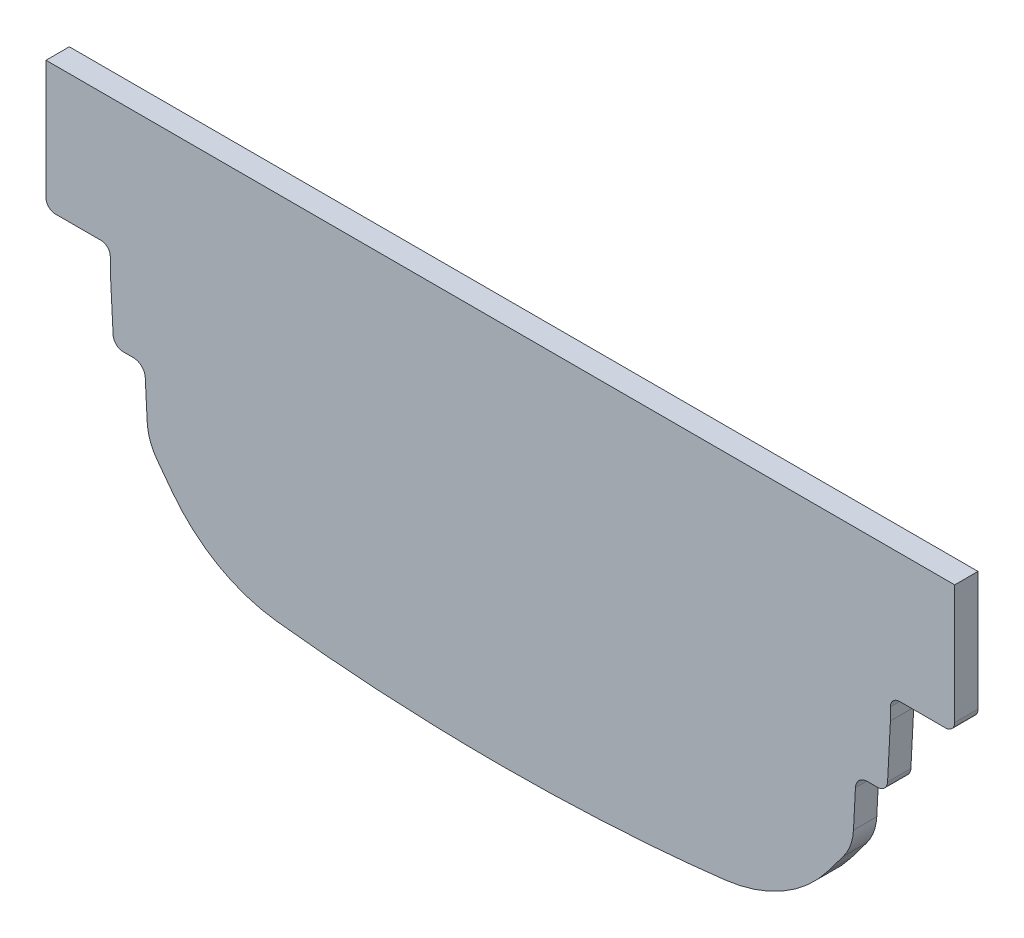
ISO-10303-21;
HEADER;
FILE_DESCRIPTION(('STEP AP214'),'2;1');
FILE_NAME('part.step','',(''),(''),'','','');
FILE_SCHEMA(('AUTOMOTIVE_DESIGN { 1 0 10303 214 1 1 1 1 }'));
ENDSEC;
DATA;
#1=APPLICATION_CONTEXT('core data for automotive mechanical design processes');
#2=APPLICATION_PROTOCOL_DEFINITION('international standard','automotive_design',2000,#1);
#3=PRODUCT_CONTEXT('',#1,'mechanical');
#4=PRODUCT('Part','Part','',(#3));
#5=PRODUCT_RELATED_PRODUCT_CATEGORY('part','',(#4));
#6=PRODUCT_DEFINITION_FORMATION('','',#4);
#7=PRODUCT_DEFINITION_CONTEXT('part definition',#1,'design');
#8=PRODUCT_DEFINITION('design','',#6,#7);
#9=PRODUCT_DEFINITION_SHAPE('','',#8);
#10=(LENGTH_UNIT() NAMED_UNIT(*) SI_UNIT(.MILLI.,.METRE.));
#11=(NAMED_UNIT(*) PLANE_ANGLE_UNIT() SI_UNIT($,.RADIAN.));
#12=(NAMED_UNIT(*) SI_UNIT($,.STERADIAN.) SOLID_ANGLE_UNIT());
#13=UNCERTAINTY_MEASURE_WITH_UNIT(LENGTH_MEASURE(1.E-05),#10,'distance_accuracy_value','');
#14=(GEOMETRIC_REPRESENTATION_CONTEXT(3) GLOBAL_UNCERTAINTY_ASSIGNED_CONTEXT((#13)) GLOBAL_UNIT_ASSIGNED_CONTEXT((#10,
#11,#12)) REPRESENTATION_CONTEXT('',''));
#15=CARTESIAN_POINT('',(0.,0.,0.));
#16=DIRECTION('',(0.,0.,1.));
#17=DIRECTION('',(1.,0.,0.));
#18=AXIS2_PLACEMENT_3D('',#15,#16,#17);
#19=CARTESIAN_POINT('',(2.41085328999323E-11,-224.706000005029,52.05));
#20=CARTESIAN_POINT('',(20.4163783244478,-224.706022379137,52.05));
#21=CARTESIAN_POINT('',(61.2536807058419,-223.588540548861,52.05));
#22=CARTESIAN_POINT('',(101.945891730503,-220.139537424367,52.05));
#23=CARTESIAN_POINT('',(122.213388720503,-217.742637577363,52.05));
#24=B_SPLINE_CURVE_WITH_KNOTS('',3,(#19,#20,#21,#22,#23),.UNSPECIFIED.,.F.,.F.,(4,1,4),(0.,
0.249955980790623,0.499955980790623),.UNSPECIFIED.);
#25=DIRECTION('',(0.,0.,1.));
#26=VECTOR('',#25,1.);
#27=SURFACE_OF_LINEAR_EXTRUSION('',#24,#26);
#28=CARTESIAN_POINT('',(2.41085328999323E-11,-224.706000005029,64.75));
#29=CARTESIAN_POINT('',(20.4163783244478,-224.706022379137,64.75));
#30=CARTESIAN_POINT('',(61.2536807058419,-223.588540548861,64.75));
#31=CARTESIAN_POINT('',(101.945891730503,-220.139537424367,64.75));
#32=CARTESIAN_POINT('',(122.213388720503,-217.742637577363,64.75));
#33=B_SPLINE_CURVE_WITH_KNOTS('',3,(#28,#29,#30,#31,#32),.UNSPECIFIED.,.F.,.F.,(4,1,4),(0.,
0.249955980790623,0.499955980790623),.UNSPECIFIED.);
#34=CARTESIAN_POINT('',(2.41085328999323E-11,-224.706000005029,64.75));
#35=VERTEX_POINT('',#34);
#36=CARTESIAN_POINT('',(122.2133887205,-217.742637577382,64.75));
#37=VERTEX_POINT('',#36);
#38=EDGE_CURVE('E263',#35,#37,#33,.T.);
#39=ORIENTED_EDGE('',*,*,#38,.F.);
#40=DIRECTION('',(0.,0.,1.));
#41=VECTOR('',#40,1.);
#42=CARTESIAN_POINT('',(2.41085328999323E-11,-224.706000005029,52.05));
#43=LINE('',#42,#41);
#44=CARTESIAN_POINT('',(2.41085328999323E-11,-224.706000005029,52.05));
#45=VERTEX_POINT('',#44);
#46=EDGE_CURVE('E11',#45,#35,#43,.T.);
#47=ORIENTED_EDGE('',*,*,#46,.F.);
#48=CARTESIAN_POINT('',(122.2133887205,-217.742637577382,52.05));
#49=VERTEX_POINT('',#48);
#50=EDGE_CURVE('E390',#45,#49,#24,.T.);
#51=ORIENTED_EDGE('',*,*,#50,.T.);
#52=DIRECTION('',(0.,0.,1.));
#53=VECTOR('',#52,1.);
#54=CARTESIAN_POINT('',(122.2133887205,-217.742637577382,52.05));
#55=LINE('',#54,#53);
#56=EDGE_CURVE('E40',#49,#37,#55,.T.);
#57=ORIENTED_EDGE('',*,*,#56,.T.);
#58=EDGE_LOOP('',(#39,#47,#51,#57));
#59=FACE_BOUND('',#58,.T.);
#60=ADVANCED_FACE('F36',(#59),#27,.T.);
#61=CARTESIAN_POINT('',(-122.213388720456,-217.742637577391,52.05));
#62=CARTESIAN_POINT('',(-101.945891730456,-220.139537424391,52.05));
#63=CARTESIAN_POINT('',(-61.2536807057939,-223.588540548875,52.05));
#64=CARTESIAN_POINT('',(-20.4163783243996,-224.706022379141,52.05));
#65=CARTESIAN_POINT('',(2.41085328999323E-11,-224.706000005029,52.05));
#66=B_SPLINE_CURVE_WITH_KNOTS('',3,(#61,#62,#63,#64,#65),.UNSPECIFIED.,.F.,.F.,(4,1,4),(0.,0.25,
0.499955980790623),.UNSPECIFIED.);
#67=DIRECTION('',(0.,0.,1.));
#68=VECTOR('',#67,1.);
#69=SURFACE_OF_LINEAR_EXTRUSION('',#66,#68);
#70=CARTESIAN_POINT('',(-122.213388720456,-217.742637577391,64.75));
#71=CARTESIAN_POINT('',(-101.945891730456,-220.139537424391,64.75));
#72=CARTESIAN_POINT('',(-61.2536807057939,-223.588540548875,64.75));
#73=CARTESIAN_POINT('',(-20.4163783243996,-224.706022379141,64.75));
#74=CARTESIAN_POINT('',(2.41085328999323E-11,-224.706000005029,64.75));
#75=B_SPLINE_CURVE_WITH_KNOTS('',3,(#70,#71,#72,#73,#74),.UNSPECIFIED.,.F.,.F.,(4,1,4),(0.,0.25,
0.499955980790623),.UNSPECIFIED.);
#76=CARTESIAN_POINT('',(-122.213388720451,-217.742637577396,64.75));
#77=VERTEX_POINT('',#76);
#78=EDGE_CURVE('E389',#77,#35,#75,.T.);
#79=ORIENTED_EDGE('',*,*,#78,.F.);
#80=DIRECTION('',(0.,0.,1.));
#81=VECTOR('',#80,1.);
#82=CARTESIAN_POINT('',(-122.213388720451,-217.742637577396,52.05));
#83=LINE('',#82,#81);
#84=CARTESIAN_POINT('',(-122.213388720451,-217.742637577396,52.05));
#85=VERTEX_POINT('',#84);
#86=EDGE_CURVE('E46',#85,#77,#83,.T.);
#87=ORIENTED_EDGE('',*,*,#86,.F.);
#88=EDGE_CURVE('E250',#85,#45,#66,.T.);
#89=ORIENTED_EDGE('',*,*,#88,.T.);
#90=ORIENTED_EDGE('',*,*,#46,.T.);
#91=EDGE_LOOP('',(#79,#87,#89,#90));
#92=FACE_BOUND('',#91,.T.);
#93=ADVANCED_FACE('F271',(#92),#69,.T.);
#94=CARTESIAN_POINT('',(-112.500000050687,-135.609011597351,52.05));
#95=DIRECTION('',(0.,0.,1.));
#96=DIRECTION('',(1.,0.,0.));
#97=AXIS2_PLACEMENT_3D('',#94,#95,#96);
#98=CYLINDRICAL_SURFACE('',#97,82.7060000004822);
#99=CARTESIAN_POINT('',(-112.500000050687,-135.609011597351,64.75));
#100=DIRECTION('',(0.,0.,1.));
#101=DIRECTION('',(1.,0.,0.));
#102=AXIS2_PLACEMENT_3D('',#99,#100,#101);
#103=CIRCLE('',#102,82.7060000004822);
#104=CARTESIAN_POINT('',(-178.552225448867,-185.38235743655,64.75));
#105=VERTEX_POINT('',#104);
#106=EDGE_CURVE('E237',#105,#77,#103,.T.);
#107=ORIENTED_EDGE('',*,*,#106,.F.);
#108=DIRECTION('',(0.,0.,1.));
#109=VECTOR('',#108,1.);
#110=CARTESIAN_POINT('',(-178.552225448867,-185.38235743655,52.05));
#111=LINE('',#110,#109);
#112=CARTESIAN_POINT('',(-178.552225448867,-185.38235743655,52.05));
#113=VERTEX_POINT('',#112);
#114=EDGE_CURVE('E232',#113,#105,#111,.T.);
#115=ORIENTED_EDGE('',*,*,#114,.F.);
#116=CARTESIAN_POINT('',(-112.500000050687,-135.609011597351,52.05));
#117=DIRECTION('',(0.,0.,1.));
#118=DIRECTION('',(1.,0.,0.));
#119=AXIS2_PLACEMENT_3D('',#116,#117,#118);
#120=CIRCLE('',#119,82.7060000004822);
#121=EDGE_CURVE('E235',#113,#85,#120,.T.);
#122=ORIENTED_EDGE('',*,*,#121,.T.);
#123=ORIENTED_EDGE('',*,*,#86,.T.);
#124=EDGE_LOOP('',(#107,#115,#122,#123));
#125=FACE_BOUND('',#124,.T.);
#126=ADVANCED_FACE('F234',(#125),#98,.T.);
#127=CARTESIAN_POINT('',(3277.94075375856,2419.24177759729,52.05));
#128=DIRECTION('',(0.,0.,1.));
#129=DIRECTION('',(1.,0.,0.));
#130=AXIS2_PLACEMENT_3D('',#127,#128,#129);
#131=CYLINDRICAL_SURFACE('',#130,4327.97996761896);
#132=CARTESIAN_POINT('',(3277.94075375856,2419.24177759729,64.75));
#133=DIRECTION('',(0.,0.,1.));
#134=DIRECTION('',(1.,0.,0.));
#135=AXIS2_PLACEMENT_3D('',#132,#133,#134);
#136=CIRCLE('',#135,4327.97996761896);
#137=CARTESIAN_POINT('',(-186.874544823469,-174.30127136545,64.75));
#138=VERTEX_POINT('',#137);
#139=EDGE_CURVE('E393',#138,#105,#136,.T.);
#140=ORIENTED_EDGE('',*,*,#139,.F.);
#141=DIRECTION('',(0.,0.,1.));
#142=VECTOR('',#141,1.);
#143=CARTESIAN_POINT('',(-186.874544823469,-174.30127136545,52.05));
#144=LINE('',#143,#142);
#145=CARTESIAN_POINT('',(-186.874544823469,-174.30127136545,52.05));
#146=VERTEX_POINT('',#145);
#147=EDGE_CURVE('E242',#146,#138,#144,.T.);
#148=ORIENTED_EDGE('',*,*,#147,.F.);
#149=CARTESIAN_POINT('',(3277.94075375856,2419.24177759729,52.05));
#150=DIRECTION('',(0.,0.,1.));
#151=DIRECTION('',(1.,0.,0.));
#152=AXIS2_PLACEMENT_3D('',#149,#150,#151);
#153=CIRCLE('',#152,4327.97996761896);
#154=EDGE_CURVE('E248',#146,#113,#153,.T.);
#155=ORIENTED_EDGE('',*,*,#154,.T.);
#156=ORIENTED_EDGE('',*,*,#114,.T.);
#157=EDGE_LOOP('',(#140,#148,#155,#156));
#158=FACE_BOUND('',#157,.T.);
#159=ADVANCED_FACE('F252',(#158),#131,.T.);
#160=CARTESIAN_POINT('',(-164.859096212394,-157.821889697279,52.05));
#161=DIRECTION('',(0.,0.,1.));
#162=DIRECTION('',(1.,0.,0.));
#163=AXIS2_PLACEMENT_3D('',#160,#161,#162);
#164=CYLINDRICAL_SURFACE('',#163,27.4999999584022);
#165=CARTESIAN_POINT('',(-164.859096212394,-157.821889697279,64.75));
#166=DIRECTION('',(0.,0.,1.));
#167=DIRECTION('',(1.,0.,0.));
#168=AXIS2_PLACEMENT_3D('',#165,#166,#167);
#169=CIRCLE('',#168,27.4999999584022);
#170=CARTESIAN_POINT('',(-192.321408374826,-159.261128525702,64.75));
#171=VERTEX_POINT('',#170);
#172=EDGE_CURVE('E525',#171,#138,#169,.T.);
#173=ORIENTED_EDGE('',*,*,#172,.F.);
#174=DIRECTION('',(0.,0.,1.));
#175=VECTOR('',#174,1.);
#176=CARTESIAN_POINT('',(-192.321408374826,-159.261128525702,52.05));
#177=LINE('',#176,#175);
#178=CARTESIAN_POINT('',(-192.321408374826,-159.261128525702,52.05));
#179=VERTEX_POINT('',#178);
#180=EDGE_CURVE('E404',#179,#171,#177,.T.);
#181=ORIENTED_EDGE('',*,*,#180,.F.);
#182=CARTESIAN_POINT('',(-164.859096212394,-157.821889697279,52.05));
#183=DIRECTION('',(0.,0.,1.));
#184=DIRECTION('',(1.,0.,0.));
#185=AXIS2_PLACEMENT_3D('',#182,#183,#184);
#186=CIRCLE('',#185,27.4999999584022);
#187=EDGE_CURVE('E253',#179,#146,#186,.T.);
#188=ORIENTED_EDGE('',*,*,#187,.T.);
#189=ORIENTED_EDGE('',*,*,#147,.T.);
#190=EDGE_LOOP('',(#173,#181,#188,#189));
#191=FACE_BOUND('',#190,.T.);
#192=ADVANCED_FACE('F281',(#191),#164,.T.);
#193=CARTESIAN_POINT('',(-193.401077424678,-138.659816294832,52.05));
#194=DIRECTION('',(-0.998629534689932,-0.0523359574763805,0.));
#195=DIRECTION('',(0.0523359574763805,-0.998629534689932,0.));
#196=AXIS2_PLACEMENT_3D('',#193,#194,#195);
#197=PLANE('',#196);
#198=DIRECTION('',(0.0523359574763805,-0.998629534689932,0.));
#199=VECTOR('',#198,1.);
#200=CARTESIAN_POINT('',(-193.401077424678,-138.659816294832,64.75));
#201=LINE('',#200,#199);
#202=CARTESIAN_POINT('',(-193.401077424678,-138.659816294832,64.75));
#203=VERTEX_POINT('',#202);
#204=EDGE_CURVE('E522',#203,#171,#201,.T.);
#205=ORIENTED_EDGE('',*,*,#204,.F.);
#206=DIRECTION('',(0.,0.,1.));
#207=VECTOR('',#206,1.);
#208=CARTESIAN_POINT('',(-193.401077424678,-138.659816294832,52.05));
#209=LINE('',#208,#207);
#210=CARTESIAN_POINT('',(-193.401077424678,-138.659816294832,52.05));
#211=VERTEX_POINT('',#210);
#212=EDGE_CURVE('E406',#211,#203,#209,.T.);
#213=ORIENTED_EDGE('',*,*,#212,.F.);
#214=DIRECTION('',(0.0523359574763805,-0.998629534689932,0.));
#215=VECTOR('',#214,1.);
#216=CARTESIAN_POINT('',(-193.401077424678,-138.659816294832,52.05));
#217=LINE('',#216,#215);
#218=EDGE_CURVE('E255',#211,#179,#217,.T.);
#219=ORIENTED_EDGE('',*,*,#218,.T.);
#220=ORIENTED_EDGE('',*,*,#180,.T.);
#221=EDGE_LOOP('',(#205,#213,#219,#220));
#222=FACE_BOUND('',#221,.T.);
#223=ADVANCED_FACE('F284',(#222),#197,.T.);
#224=CARTESIAN_POINT('',(-199.892169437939,-139.000000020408,52.05));
#225=DIRECTION('',(0.,0.,1.));
#226=DIRECTION('',(1.,0.,0.));
#227=AXIS2_PLACEMENT_3D('',#224,#225,#226);
#228=CYLINDRICAL_SURFACE('',#227,6.50000003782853);
#229=CARTESIAN_POINT('',(-199.892169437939,-139.000000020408,64.75));
#230=DIRECTION('',(0.,0.,-1.));
#231=DIRECTION('',(-1.,0.,0.));
#232=AXIS2_PLACEMENT_3D('',#229,#230,#231);
#233=CIRCLE('',#232,6.50000003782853);
#234=CARTESIAN_POINT('',(-199.892169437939,-132.499999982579,64.75));
#235=VERTEX_POINT('',#234);
#236=EDGE_CURVE('E519',#235,#203,#233,.T.);
#237=ORIENTED_EDGE('',*,*,#236,.F.);
#238=DIRECTION('',(0.,0.,1.));
#239=VECTOR('',#238,1.);
#240=CARTESIAN_POINT('',(-199.892169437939,-132.499999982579,52.05));
#241=LINE('',#240,#239);
#242=CARTESIAN_POINT('',(-199.892169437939,-132.499999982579,52.05));
#243=VERTEX_POINT('',#242);
#244=EDGE_CURVE('E408',#243,#235,#241,.T.);
#245=ORIENTED_EDGE('',*,*,#244,.F.);
#246=CARTESIAN_POINT('',(-199.892169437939,-139.000000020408,52.05));
#247=DIRECTION('',(0.,0.,-1.));
#248=DIRECTION('',(-1.,0.,0.));
#249=AXIS2_PLACEMENT_3D('',#246,#247,#248);
#250=CIRCLE('',#249,6.50000003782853);
#251=EDGE_CURVE('E533',#243,#211,#250,.T.);
#252=ORIENTED_EDGE('',*,*,#251,.T.);
#253=ORIENTED_EDGE('',*,*,#212,.T.);
#254=EDGE_LOOP('',(#237,#245,#252,#253));
#255=FACE_BOUND('',#254,.T.);
#256=ADVANCED_FACE('F288',(#255),#228,.F.);
#257=CARTESIAN_POINT('',(-205.408283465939,-132.499999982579,52.05));
#258=DIRECTION('',(0.,-1.,0.));
#259=DIRECTION('',(1.,0.,0.));
#260=AXIS2_PLACEMENT_3D('',#257,#258,#259);
#261=PLANE('',#260);
#262=DIRECTION('',(1.,0.,0.));
#263=VECTOR('',#262,1.);
#264=CARTESIAN_POINT('',(-205.408283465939,-132.499999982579,64.75));
#265=LINE('',#264,#263);
#266=CARTESIAN_POINT('',(-205.408283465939,-132.499999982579,64.75));
#267=VERTEX_POINT('',#266);
#268=EDGE_CURVE('E516',#267,#235,#265,.T.);
#269=ORIENTED_EDGE('',*,*,#268,.F.);
#270=DIRECTION('',(0.,0.,1.));
#271=VECTOR('',#270,1.);
#272=CARTESIAN_POINT('',(-205.408283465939,-132.499999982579,52.05));
#273=LINE('',#272,#271);
#274=CARTESIAN_POINT('',(-205.408283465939,-132.499999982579,52.05));
#275=VERTEX_POINT('',#274);
#276=EDGE_CURVE('E410',#275,#267,#273,.T.);
#277=ORIENTED_EDGE('',*,*,#276,.F.);
#278=DIRECTION('',(1.,0.,0.));
#279=VECTOR('',#278,1.);
#280=CARTESIAN_POINT('',(-205.408283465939,-132.499999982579,52.05));
#281=LINE('',#280,#279);
#282=EDGE_CURVE('E534',#275,#243,#281,.T.);
#283=ORIENTED_EDGE('',*,*,#282,.T.);
#284=ORIENTED_EDGE('',*,*,#244,.T.);
#285=EDGE_LOOP('',(#269,#277,#283,#284));
#286=FACE_BOUND('',#285,.T.);
#287=ADVANCED_FACE('F292',(#286),#261,.T.);
#288=CARTESIAN_POINT('',(-205.408283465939,-126.999999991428,52.05));
#289=DIRECTION('',(0.,0.,1.));
#290=DIRECTION('',(1.,0.,0.));
#291=AXIS2_PLACEMENT_3D('',#288,#289,#290);
#292=CYLINDRICAL_SURFACE('',#291,5.49999999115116);
#293=CARTESIAN_POINT('',(-205.408283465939,-126.999999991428,64.75));
#294=DIRECTION('',(0.,0.,1.));
#295=DIRECTION('',(1.,0.,0.));
#296=AXIS2_PLACEMENT_3D('',#293,#294,#295);
#297=CIRCLE('',#296,5.49999999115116);
#298=CARTESIAN_POINT('',(-210.900745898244,-127.287847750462,64.75));
#299=VERTEX_POINT('',#298);
#300=EDGE_CURVE('E513',#299,#267,#297,.T.);
#301=ORIENTED_EDGE('',*,*,#300,.F.);
#302=DIRECTION('',(0.,0.,1.));
#303=VECTOR('',#302,1.);
#304=CARTESIAN_POINT('',(-210.900745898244,-127.287847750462,52.05));
#305=LINE('',#304,#303);
#306=CARTESIAN_POINT('',(-210.900745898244,-127.287847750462,52.05));
#307=VERTEX_POINT('',#306);
#308=EDGE_CURVE('E412',#307,#299,#305,.T.);
#309=ORIENTED_EDGE('',*,*,#308,.F.);
#310=CARTESIAN_POINT('',(-205.408283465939,-126.999999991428,52.05));
#311=DIRECTION('',(0.,0.,1.));
#312=DIRECTION('',(1.,0.,0.));
#313=AXIS2_PLACEMENT_3D('',#310,#311,#312);
#314=CIRCLE('',#313,5.49999999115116);
#315=EDGE_CURVE('E539',#307,#275,#314,.T.);
#316=ORIENTED_EDGE('',*,*,#315,.T.);
#317=ORIENTED_EDGE('',*,*,#276,.T.);
#318=EDGE_LOOP('',(#301,#309,#316,#317));
#319=FACE_BOUND('',#318,.T.);
#320=ADVANCED_FACE('F296',(#319),#292,.T.);
#321=CARTESIAN_POINT('',(-212.45348523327,-97.6598162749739,52.05));
#322=DIRECTION('',(-0.998629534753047,-0.0523359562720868,0.));
#323=DIRECTION('',(0.0523359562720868,-0.998629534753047,0.));
#324=AXIS2_PLACEMENT_3D('',#321,#322,#323);
#325=PLANE('',#324);
#326=DIRECTION('',(0.0523359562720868,-0.998629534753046,0.));
#327=VECTOR('',#326,1.);
#328=CARTESIAN_POINT('',(-212.45348523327,-97.6598162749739,64.75));
#329=LINE('',#328,#327);
#330=CARTESIAN_POINT('',(-212.45348523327,-97.6598162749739,64.75));
#331=VERTEX_POINT('',#330);
#332=EDGE_CURVE('E510',#331,#299,#329,.T.);
#333=ORIENTED_EDGE('',*,*,#332,.F.);
#334=DIRECTION('',(0.,0.,1.));
#335=VECTOR('',#334,1.);
#336=CARTESIAN_POINT('',(-212.45348523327,-97.6598162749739,52.05));
#337=LINE('',#336,#335);
#338=CARTESIAN_POINT('',(-212.45348523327,-97.6598162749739,52.05));
#339=VERTEX_POINT('',#338);
#340=EDGE_CURVE('E414',#339,#331,#337,.T.);
#341=ORIENTED_EDGE('',*,*,#340,.F.);
#342=DIRECTION('',(0.0523359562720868,-0.998629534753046,0.));
#343=VECTOR('',#342,1.);
#344=CARTESIAN_POINT('',(-212.45348523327,-97.6598162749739,52.05));
#345=LINE('',#344,#343);
#346=EDGE_CURVE('E542',#339,#307,#345,.T.);
#347=ORIENTED_EDGE('',*,*,#346,.T.);
#348=ORIENTED_EDGE('',*,*,#308,.T.);
#349=EDGE_LOOP('',(#333,#341,#347,#348));
#350=FACE_BOUND('',#349,.T.);
#351=ADVANCED_FACE('F300',(#350),#325,.T.);
#352=CARTESIAN_POINT('',(-212.45348523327,-90.9999999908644,52.05));
#353=DIRECTION('',(-1.,0.,0.));
#354=DIRECTION('',(0.,0.,1.));
#355=AXIS2_PLACEMENT_3D('',#352,#353,#354);
#356=PLANE('',#355);
#357=DIRECTION('',(0.,-1.,0.));
#358=VECTOR('',#357,1.);
#359=CARTESIAN_POINT('',(-212.45348523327,-90.9999999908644,64.75));
#360=LINE('',#359,#358);
#361=CARTESIAN_POINT('',(-212.45348523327,-90.9999999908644,64.75));
#362=VERTEX_POINT('',#361);
#363=EDGE_CURVE('E507',#362,#331,#360,.T.);
#364=ORIENTED_EDGE('',*,*,#363,.F.);
#365=DIRECTION('',(0.,0.,1.));
#366=VECTOR('',#365,1.);
#367=CARTESIAN_POINT('',(-212.45348523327,-90.9999999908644,52.05));
#368=LINE('',#367,#366);
#369=CARTESIAN_POINT('',(-212.45348523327,-90.9999999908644,52.05));
#370=VERTEX_POINT('',#369);
#371=EDGE_CURVE('E416',#370,#362,#368,.T.);
#372=ORIENTED_EDGE('',*,*,#371,.F.);
#373=DIRECTION('',(0.,-1.,0.));
#374=VECTOR('',#373,1.);
#375=CARTESIAN_POINT('',(-212.45348523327,-90.9999999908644,52.05));
#376=LINE('',#375,#374);
#377=EDGE_CURVE('E545',#370,#339,#376,.T.);
#378=ORIENTED_EDGE('',*,*,#377,.T.);
#379=ORIENTED_EDGE('',*,*,#340,.T.);
#380=EDGE_LOOP('',(#364,#372,#378,#379));
#381=FACE_BOUND('',#380,.T.);
#382=ADVANCED_FACE('F304',(#381),#356,.T.);
#383=CARTESIAN_POINT('',(-217.45348523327,-90.9999999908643,52.05));
#384=DIRECTION('',(0.,0.,1.));
#385=DIRECTION('',(1.,0.,0.));
#386=AXIS2_PLACEMENT_3D('',#383,#384,#385);
#387=CYLINDRICAL_SURFACE('',#386,5.);
#388=CARTESIAN_POINT('',(-217.45348523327,-90.9999999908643,64.75));
#389=DIRECTION('',(0.,0.,-1.));
#390=DIRECTION('',(-1.,0.,0.));
#391=AXIS2_PLACEMENT_3D('',#388,#389,#390);
#392=CIRCLE('',#391,5.);
#393=CARTESIAN_POINT('',(-217.45348523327,-85.9999999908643,64.75));
#394=VERTEX_POINT('',#393);
#395=EDGE_CURVE('E504',#394,#362,#392,.T.);
#396=ORIENTED_EDGE('',*,*,#395,.F.);
#397=DIRECTION('',(0.,0.,1.));
#398=VECTOR('',#397,1.);
#399=CARTESIAN_POINT('',(-217.45348523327,-85.9999999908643,52.05));
#400=LINE('',#399,#398);
#401=CARTESIAN_POINT('',(-217.45348523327,-85.9999999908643,52.05));
#402=VERTEX_POINT('',#401);
#403=EDGE_CURVE('E418',#402,#394,#400,.T.);
#404=ORIENTED_EDGE('',*,*,#403,.F.);
#405=CARTESIAN_POINT('',(-217.45348523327,-90.9999999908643,52.05));
#406=DIRECTION('',(0.,0.,-1.));
#407=DIRECTION('',(-1.,0.,0.));
#408=AXIS2_PLACEMENT_3D('',#405,#406,#407);
#409=CIRCLE('',#408,5.);
#410=EDGE_CURVE('E548',#402,#370,#409,.T.);
#411=ORIENTED_EDGE('',*,*,#410,.T.);
#412=ORIENTED_EDGE('',*,*,#371,.T.);
#413=EDGE_LOOP('',(#396,#404,#411,#412));
#414=FACE_BOUND('',#413,.T.);
#415=ADVANCED_FACE('F308',(#414),#387,.F.);
#416=CARTESIAN_POINT('',(-242.45348523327,-85.9999999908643,52.05));
#417=DIRECTION('',(0.,-1.,0.));
#418=DIRECTION('',(1.,0.,0.));
#419=AXIS2_PLACEMENT_3D('',#416,#417,#418);
#420=PLANE('',#419);
#421=DIRECTION('',(1.,0.,0.));
#422=VECTOR('',#421,1.);
#423=CARTESIAN_POINT('',(-242.45348523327,-85.9999999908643,64.75));
#424=LINE('',#423,#422);
#425=CARTESIAN_POINT('',(-242.45348523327,-85.9999999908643,64.75));
#426=VERTEX_POINT('',#425);
#427=EDGE_CURVE('E501',#426,#394,#424,.T.);
#428=ORIENTED_EDGE('',*,*,#427,.F.);
#429=DIRECTION('',(0.,0.,1.));
#430=VECTOR('',#429,1.);
#431=CARTESIAN_POINT('',(-242.45348523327,-85.9999999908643,52.05));
#432=LINE('',#431,#430);
#433=CARTESIAN_POINT('',(-242.45348523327,-85.9999999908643,52.05));
#434=VERTEX_POINT('',#433);
#435=EDGE_CURVE('E420',#434,#426,#432,.T.);
#436=ORIENTED_EDGE('',*,*,#435,.F.);
#437=DIRECTION('',(1.,0.,0.));
#438=VECTOR('',#437,1.);
#439=CARTESIAN_POINT('',(-242.45348523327,-85.9999999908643,52.05));
#440=LINE('',#439,#438);
#441=EDGE_CURVE('E551',#434,#402,#440,.T.);
#442=ORIENTED_EDGE('',*,*,#441,.T.);
#443=ORIENTED_EDGE('',*,*,#403,.T.);
#444=EDGE_LOOP('',(#428,#436,#442,#443));
#445=FACE_BOUND('',#444,.T.);
#446=ADVANCED_FACE('F312',(#445),#420,.T.);
#447=CARTESIAN_POINT('',(-242.45348523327,-80.9999999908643,52.05));
#448=DIRECTION('',(0.,0.,1.));
#449=DIRECTION('',(1.,0.,0.));
#450=AXIS2_PLACEMENT_3D('',#447,#448,#449);
#451=CYLINDRICAL_SURFACE('',#450,5.);
#452=CARTESIAN_POINT('',(-242.45348523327,-80.9999999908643,64.75));
#453=DIRECTION('',(0.,0.,1.));
#454=DIRECTION('',(1.,0.,0.));
#455=AXIS2_PLACEMENT_3D('',#452,#453,#454);
#456=CIRCLE('',#455,5.);
#457=CARTESIAN_POINT('',(-247.45348523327,-80.9999999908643,64.75));
#458=VERTEX_POINT('',#457);
#459=EDGE_CURVE('E498',#458,#426,#456,.T.);
#460=ORIENTED_EDGE('',*,*,#459,.F.);
#461=DIRECTION('',(0.,0.,1.));
#462=VECTOR('',#461,1.);
#463=CARTESIAN_POINT('',(-247.45348523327,-80.9999999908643,52.05));
#464=LINE('',#463,#462);
#465=CARTESIAN_POINT('',(-247.45348523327,-80.9999999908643,52.05));
#466=VERTEX_POINT('',#465);
#467=EDGE_CURVE('E422',#466,#458,#464,.T.);
#468=ORIENTED_EDGE('',*,*,#467,.F.);
#469=CARTESIAN_POINT('',(-242.45348523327,-80.9999999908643,52.05));
#470=DIRECTION('',(0.,0.,1.));
#471=DIRECTION('',(1.,0.,0.));
#472=AXIS2_PLACEMENT_3D('',#469,#470,#471);
#473=CIRCLE('',#472,5.);
#474=EDGE_CURVE('E554',#466,#434,#473,.T.);
#475=ORIENTED_EDGE('',*,*,#474,.T.);
#476=ORIENTED_EDGE('',*,*,#435,.T.);
#477=EDGE_LOOP('',(#460,#468,#475,#476));
#478=FACE_BOUND('',#477,.T.);
#479=ADVANCED_FACE('F316',(#478),#451,.T.);
#480=CARTESIAN_POINT('',(-247.45348523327,-15.9999999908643,52.05));
#481=DIRECTION('',(-1.,0.,0.));
#482=DIRECTION('',(0.,0.,1.));
#483=AXIS2_PLACEMENT_3D('',#480,#481,#482);
#484=PLANE('',#483);
#485=DIRECTION('',(0.,-1.,0.));
#486=VECTOR('',#485,1.);
#487=CARTESIAN_POINT('',(-247.45348523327,-15.9999999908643,64.75));
#488=LINE('',#487,#486);
#489=CARTESIAN_POINT('',(-247.45348523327,-15.9999999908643,64.75));
#490=VERTEX_POINT('',#489);
#491=EDGE_CURVE('E495',#490,#458,#488,.T.);
#492=ORIENTED_EDGE('',*,*,#491,.F.);
#493=DIRECTION('',(0.,0.,1.));
#494=VECTOR('',#493,1.);
#495=CARTESIAN_POINT('',(-247.45348523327,-15.9999999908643,52.05));
#496=LINE('',#495,#494);
#497=CARTESIAN_POINT('',(-247.45348523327,-15.9999999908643,52.05));
#498=VERTEX_POINT('',#497);
#499=EDGE_CURVE('E424',#498,#490,#496,.T.);
#500=ORIENTED_EDGE('',*,*,#499,.F.);
#501=DIRECTION('',(0.,-1.,0.));
#502=VECTOR('',#501,1.);
#503=CARTESIAN_POINT('',(-247.45348523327,-15.9999999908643,52.05));
#504=LINE('',#503,#502);
#505=EDGE_CURVE('E557',#498,#466,#504,.T.);
#506=ORIENTED_EDGE('',*,*,#505,.T.);
#507=ORIENTED_EDGE('',*,*,#467,.T.);
#508=EDGE_LOOP('',(#492,#500,#506,#507));
#509=FACE_BOUND('',#508,.T.);
#510=ADVANCED_FACE('F320',(#509),#484,.T.);
#511=CARTESIAN_POINT('',(-212.453485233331,-15.9999999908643,52.05));
#512=DIRECTION('',(0.,1.,0.));
#513=DIRECTION('',(-1.,0.,0.));
#514=AXIS2_PLACEMENT_3D('',#511,#512,#513);
#515=PLANE('',#514);
#516=DIRECTION('',(-1.,0.,0.));
#517=VECTOR('',#516,1.);
#518=CARTESIAN_POINT('',(-212.453485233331,-15.9999999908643,64.75));
#519=LINE('',#518,#517);
#520=CARTESIAN_POINT('',(247.45348523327,-15.9999999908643,64.75));
#521=VERTEX_POINT('',#520);
#522=EDGE_CURVE('E492',#521,#490,#519,.T.);
#523=ORIENTED_EDGE('',*,*,#522,.F.);
#524=DIRECTION('',(0.,0.,1.));
#525=VECTOR('',#524,1.);
#526=CARTESIAN_POINT('',(247.45348523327,-15.9999999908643,52.05));
#527=LINE('',#526,#525);
#528=CARTESIAN_POINT('',(247.45348523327,-15.9999999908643,52.05));
#529=VERTEX_POINT('',#528);
#530=EDGE_CURVE('E426',#529,#521,#527,.T.);
#531=ORIENTED_EDGE('',*,*,#530,.F.);
#532=DIRECTION('',(-1.,1.40244958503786E-12,0.));
#533=VECTOR('',#532,1.);
#534=CARTESIAN_POINT('',(212.453485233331,-15.9999999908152,52.05));
#535=LINE('',#534,#533);
#536=EDGE_CURVE('E560',#529,#498,#535,.T.);
#537=ORIENTED_EDGE('',*,*,#536,.T.);
#538=ORIENTED_EDGE('',*,*,#499,.T.);
#539=EDGE_LOOP('',(#523,#531,#537,#538));
#540=FACE_BOUND('',#539,.T.);
#541=ADVANCED_FACE('F324',(#540),#515,.T.);
#542=CARTESIAN_POINT('',(247.45348523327,-15.9999999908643,52.05));
#543=DIRECTION('',(1.,0.,0.));
#544=DIRECTION('',(0.,0.,-1.));
#545=AXIS2_PLACEMENT_3D('',#542,#543,#544);
#546=PLANE('',#545);
#547=DIRECTION('',(0.,1.,0.));
#548=VECTOR('',#547,1.);
#549=CARTESIAN_POINT('',(247.45348523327,-15.9999999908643,64.75));
#550=LINE('',#549,#548);
#551=CARTESIAN_POINT('',(247.45348523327,-80.9999999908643,64.75));
#552=VERTEX_POINT('',#551);
#553=EDGE_CURVE('E489',#552,#521,#550,.T.);
#554=ORIENTED_EDGE('',*,*,#553,.F.);
#555=DIRECTION('',(0.,0.,1.));
#556=VECTOR('',#555,1.);
#557=CARTESIAN_POINT('',(247.45348523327,-80.9999999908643,52.05));
#558=LINE('',#557,#556);
#559=CARTESIAN_POINT('',(247.45348523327,-80.9999999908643,52.05));
#560=VERTEX_POINT('',#559);
#561=EDGE_CURVE('E429',#560,#552,#558,.T.);
#562=ORIENTED_EDGE('',*,*,#561,.F.);
#563=DIRECTION('',(0.,1.,0.));
#564=VECTOR('',#563,1.);
#565=CARTESIAN_POINT('',(247.45348523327,-15.9999999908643,52.05));
#566=LINE('',#565,#564);
#567=EDGE_CURVE('E562',#560,#529,#566,.T.);
#568=ORIENTED_EDGE('',*,*,#567,.T.);
#569=ORIENTED_EDGE('',*,*,#530,.T.);
#570=EDGE_LOOP('',(#554,#562,#568,#569));
#571=FACE_BOUND('',#570,.T.);
#572=ADVANCED_FACE('F328',(#571),#546,.T.);
#573=CARTESIAN_POINT('',(242.45348523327,-80.9999999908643,52.05));
#574=DIRECTION('',(0.,0.,1.));
#575=DIRECTION('',(1.,0.,0.));
#576=AXIS2_PLACEMENT_3D('',#573,#574,#575);
#577=CYLINDRICAL_SURFACE('',#576,5.);
#578=CARTESIAN_POINT('',(242.45348523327,-80.9999999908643,64.75));
#579=DIRECTION('',(0.,0.,1.));
#580=DIRECTION('',(1.,0.,0.));
#581=AXIS2_PLACEMENT_3D('',#578,#579,#580);
#582=CIRCLE('',#581,5.);
#583=CARTESIAN_POINT('',(242.45348523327,-85.9999999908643,64.75));
#584=VERTEX_POINT('',#583);
#585=EDGE_CURVE('E486',#584,#552,#582,.T.);
#586=ORIENTED_EDGE('',*,*,#585,.F.);
#587=DIRECTION('',(0.,0.,1.));
#588=VECTOR('',#587,1.);
#589=CARTESIAN_POINT('',(242.45348523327,-85.9999999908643,52.05));
#590=LINE('',#589,#588);
#591=CARTESIAN_POINT('',(242.45348523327,-85.9999999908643,52.05));
#592=VERTEX_POINT('',#591);
#593=EDGE_CURVE('E431',#592,#584,#590,.T.);
#594=ORIENTED_EDGE('',*,*,#593,.F.);
#595=CARTESIAN_POINT('',(242.45348523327,-80.9999999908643,52.05));
#596=DIRECTION('',(0.,0.,1.));
#597=DIRECTION('',(1.,0.,0.));
#598=AXIS2_PLACEMENT_3D('',#595,#596,#597);
#599=CIRCLE('',#598,5.);
#600=EDGE_CURVE('E565',#592,#560,#599,.T.);
#601=ORIENTED_EDGE('',*,*,#600,.T.);
#602=ORIENTED_EDGE('',*,*,#561,.T.);
#603=EDGE_LOOP('',(#586,#594,#601,#602));
#604=FACE_BOUND('',#603,.T.);
#605=ADVANCED_FACE('F332',(#604),#577,.T.);
#606=CARTESIAN_POINT('',(242.45348523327,-85.9999999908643,52.05));
#607=DIRECTION('',(-2.00894856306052E-12,-1.,0.));
#608=DIRECTION('',(1.,-2.00894856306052E-12,0.));
#609=AXIS2_PLACEMENT_3D('',#606,#607,#608);
#610=PLANE('',#609);
#611=DIRECTION('',(1.,-2.00894856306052E-12,0.));
#612=VECTOR('',#611,1.);
#613=CARTESIAN_POINT('',(242.45348523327,-85.9999999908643,64.75));
#614=LINE('',#613,#612);
#615=CARTESIAN_POINT('',(217.453485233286,-85.9999999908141,64.75));
#616=VERTEX_POINT('',#615);
#617=EDGE_CURVE('E483',#616,#584,#614,.T.);
#618=ORIENTED_EDGE('',*,*,#617,.F.);
#619=DIRECTION('',(0.,0.,1.));
#620=VECTOR('',#619,1.);
#621=CARTESIAN_POINT('',(217.453485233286,-85.9999999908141,52.05));
#622=LINE('',#621,#620);
#623=CARTESIAN_POINT('',(217.453485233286,-85.9999999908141,52.05));
#624=VERTEX_POINT('',#623);
#625=EDGE_CURVE('E433',#624,#616,#622,.T.);
#626=ORIENTED_EDGE('',*,*,#625,.F.);
#627=DIRECTION('',(1.,-2.00894856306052E-12,0.));
#628=VECTOR('',#627,1.);
#629=CARTESIAN_POINT('',(242.45348523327,-85.9999999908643,52.05));
#630=LINE('',#629,#628);
#631=EDGE_CURVE('E568',#624,#592,#630,.T.);
#632=ORIENTED_EDGE('',*,*,#631,.T.);
#633=ORIENTED_EDGE('',*,*,#593,.T.);
#634=EDGE_LOOP('',(#618,#626,#632,#633));
#635=FACE_BOUND('',#634,.T.);
#636=ADVANCED_FACE('F336',(#635),#610,.T.);
#637=CARTESIAN_POINT('',(217.453485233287,-90.9999999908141,52.05));
#638=DIRECTION('',(0.,0.,1.));
#639=DIRECTION('',(1.,0.,0.));
#640=AXIS2_PLACEMENT_3D('',#637,#638,#639);
#641=CYLINDRICAL_SURFACE('',#640,5.);
#642=CARTESIAN_POINT('',(217.453485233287,-90.9999999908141,64.75));
#643=DIRECTION('',(0.,0.,-1.));
#644=DIRECTION('',(1.,0.,0.));
#645=AXIS2_PLACEMENT_3D('',#642,#643,#644);
#646=CIRCLE('',#645,5.);
#647=CARTESIAN_POINT('',(212.453485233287,-90.9999999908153,64.75));
#648=VERTEX_POINT('',#647);
#649=EDGE_CURVE('E480',#648,#616,#646,.T.);
#650=ORIENTED_EDGE('',*,*,#649,.F.);
#651=DIRECTION('',(0.,0.,1.));
#652=VECTOR('',#651,1.);
#653=CARTESIAN_POINT('',(212.453485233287,-90.9999999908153,52.05));
#654=LINE('',#653,#652);
#655=CARTESIAN_POINT('',(212.453485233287,-90.9999999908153,52.05));
#656=VERTEX_POINT('',#655);
#657=EDGE_CURVE('E435',#656,#648,#654,.T.);
#658=ORIENTED_EDGE('',*,*,#657,.F.);
#659=CARTESIAN_POINT('',(217.453485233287,-90.9999999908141,52.05));
#660=DIRECTION('',(0.,0.,-1.));
#661=DIRECTION('',(1.,0.,0.));
#662=AXIS2_PLACEMENT_3D('',#659,#660,#661);
#663=CIRCLE('',#662,5.);
#664=EDGE_CURVE('E571',#656,#624,#663,.T.);
#665=ORIENTED_EDGE('',*,*,#664,.T.);
#666=ORIENTED_EDGE('',*,*,#625,.T.);
#667=EDGE_LOOP('',(#650,#658,#665,#666));
#668=FACE_BOUND('',#667,.T.);
#669=ADVANCED_FACE('F340',(#668),#641,.F.);
#670=CARTESIAN_POINT('',(212.453485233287,-90.9999999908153,52.05));
#671=DIRECTION('',(1.,2.3338665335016E-13,0.));
#672=DIRECTION('',(-2.3338665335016E-13,1.,0.));
#673=AXIS2_PLACEMENT_3D('',#670,#671,#672);
#674=PLANE('',#673);
#675=DIRECTION('',(-2.3338665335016E-13,1.,0.));
#676=VECTOR('',#675,1.);
#677=CARTESIAN_POINT('',(212.453485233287,-90.9999999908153,64.75));
#678=LINE('',#677,#676);
#679=CARTESIAN_POINT('',(212.453485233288,-97.6598162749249,64.75));
#680=VERTEX_POINT('',#679);
#681=EDGE_CURVE('E477',#680,#648,#678,.T.);
#682=ORIENTED_EDGE('',*,*,#681,.F.);
#683=DIRECTION('',(0.,0.,1.));
#684=VECTOR('',#683,1.);
#685=CARTESIAN_POINT('',(212.453485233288,-97.6598162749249,52.05));
#686=LINE('',#685,#684);
#687=CARTESIAN_POINT('',(212.453485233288,-97.6598162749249,52.05));
#688=VERTEX_POINT('',#687);
#689=EDGE_CURVE('E437',#688,#680,#686,.T.);
#690=ORIENTED_EDGE('',*,*,#689,.F.);
#691=DIRECTION('',(-2.3338665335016E-13,1.,0.));
#692=VECTOR('',#691,1.);
#693=CARTESIAN_POINT('',(212.453485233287,-90.9999999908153,52.05));
#694=LINE('',#693,#692);
#695=EDGE_CURVE('E574',#688,#656,#694,.T.);
#696=ORIENTED_EDGE('',*,*,#695,.T.);
#697=ORIENTED_EDGE('',*,*,#657,.T.);
#698=EDGE_LOOP('',(#682,#690,#696,#697));
#699=FACE_BOUND('',#698,.T.);
#700=ADVANCED_FACE('F344',(#699),#674,.T.);
#701=CARTESIAN_POINT('',(212.453485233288,-97.6598162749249,52.05));
#702=DIRECTION('',(0.998629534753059,-0.0523359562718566,0.));
#703=DIRECTION('',(0.0523359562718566,0.998629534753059,0.));
#704=AXIS2_PLACEMENT_3D('',#701,#702,#703);
#705=PLANE('',#704);
#706=DIRECTION('',(0.0523359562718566,0.998629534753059,0.));
#707=VECTOR('',#706,1.);
#708=CARTESIAN_POINT('',(212.453485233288,-97.6598162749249,64.75));
#709=LINE('',#708,#707);
#710=CARTESIAN_POINT('',(210.90074589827,-127.287847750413,64.75));
#711=VERTEX_POINT('',#710);
#712=EDGE_CURVE('E474',#711,#680,#709,.T.);
#713=ORIENTED_EDGE('',*,*,#712,.F.);
#714=DIRECTION('',(0.,0.,1.));
#715=VECTOR('',#714,1.);
#716=CARTESIAN_POINT('',(210.90074589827,-127.287847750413,52.05));
#717=LINE('',#716,#715);
#718=CARTESIAN_POINT('',(210.90074589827,-127.287847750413,52.05));
#719=VERTEX_POINT('',#718);
#720=EDGE_CURVE('E439',#719,#711,#717,.T.);
#721=ORIENTED_EDGE('',*,*,#720,.F.);
#722=DIRECTION('',(0.0523359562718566,0.998629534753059,0.));
#723=VECTOR('',#722,1.);
#724=CARTESIAN_POINT('',(212.453485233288,-97.6598162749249,52.05));
#725=LINE('',#724,#723);
#726=EDGE_CURVE('E577',#719,#688,#725,.T.);
#727=ORIENTED_EDGE('',*,*,#726,.T.);
#728=ORIENTED_EDGE('',*,*,#689,.T.);
#729=EDGE_LOOP('',(#713,#721,#727,#728));
#730=FACE_BOUND('',#729,.T.);
#731=ADVANCED_FACE('F348',(#730),#705,.T.);
#732=CARTESIAN_POINT('',(205.408283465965,-126.999999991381,52.05));
#733=DIRECTION('',(0.,0.,1.));
#734=DIRECTION('',(1.,0.,0.));
#735=AXIS2_PLACEMENT_3D('',#732,#733,#734);
#736=CYLINDRICAL_SURFACE('',#735,5.49999999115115);
#737=CARTESIAN_POINT('',(205.408283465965,-126.999999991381,64.75));
#738=DIRECTION('',(0.,0.,1.));
#739=DIRECTION('',(-1.,0.,0.));
#740=AXIS2_PLACEMENT_3D('',#737,#738,#739);
#741=CIRCLE('',#740,5.49999999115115);
#742=CARTESIAN_POINT('',(205.408283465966,-132.499999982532,64.75));
#743=VERTEX_POINT('',#742);
#744=EDGE_CURVE('E471',#743,#711,#741,.T.);
#745=ORIENTED_EDGE('',*,*,#744,.F.);
#746=DIRECTION('',(0.,0.,1.));
#747=VECTOR('',#746,1.);
#748=CARTESIAN_POINT('',(205.408283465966,-132.499999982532,52.05));
#749=LINE('',#748,#747);
#750=CARTESIAN_POINT('',(205.408283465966,-132.499999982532,52.05));
#751=VERTEX_POINT('',#750);
#752=EDGE_CURVE('E441',#751,#743,#749,.T.);
#753=ORIENTED_EDGE('',*,*,#752,.F.);
#754=CARTESIAN_POINT('',(205.408283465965,-126.999999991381,52.05));
#755=DIRECTION('',(0.,0.,1.));
#756=DIRECTION('',(-1.,0.,0.));
#757=AXIS2_PLACEMENT_3D('',#754,#755,#756);
#758=CIRCLE('',#757,5.49999999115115);
#759=EDGE_CURVE('E580',#751,#719,#758,.T.);
#760=ORIENTED_EDGE('',*,*,#759,.T.);
#761=ORIENTED_EDGE('',*,*,#720,.T.);
#762=EDGE_LOOP('',(#745,#753,#760,#761));
#763=FACE_BOUND('',#762,.T.);
#764=ADVANCED_FACE('F352',(#763),#736,.T.);
#765=CARTESIAN_POINT('',(205.408283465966,-132.499999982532,52.05));
#766=DIRECTION('',(2.36491132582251E-13,-1.,0.));
#767=DIRECTION('',(1.,2.36491132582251E-13,0.));
#768=AXIS2_PLACEMENT_3D('',#765,#766,#767);
#769=PLANE('',#768);
#770=DIRECTION('',(1.,2.36491132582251E-13,0.));
#771=VECTOR('',#770,1.);
#772=CARTESIAN_POINT('',(205.408283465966,-132.499999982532,64.75));
#773=LINE('',#772,#771);
#774=CARTESIAN_POINT('',(199.892169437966,-132.499999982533,64.75));
#775=VERTEX_POINT('',#774);
#776=EDGE_CURVE('E468',#775,#743,#773,.T.);
#777=ORIENTED_EDGE('',*,*,#776,.F.);
#778=DIRECTION('',(0.,0.,1.));
#779=VECTOR('',#778,1.);
#780=CARTESIAN_POINT('',(199.892169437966,-132.499999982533,52.05));
#781=LINE('',#780,#779);
#782=CARTESIAN_POINT('',(199.892169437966,-132.499999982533,52.05));
#783=VERTEX_POINT('',#782);
#784=EDGE_CURVE('E443',#783,#775,#781,.T.);
#785=ORIENTED_EDGE('',*,*,#784,.F.);
#786=DIRECTION('',(1.,2.36491132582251E-13,0.));
#787=VECTOR('',#786,1.);
#788=CARTESIAN_POINT('',(205.408283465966,-132.499999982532,52.05));
#789=LINE('',#788,#787);
#790=EDGE_CURVE('E583',#783,#751,#789,.T.);
#791=ORIENTED_EDGE('',*,*,#790,.T.);
#792=ORIENTED_EDGE('',*,*,#752,.T.);
#793=EDGE_LOOP('',(#777,#785,#791,#792));
#794=FACE_BOUND('',#793,.T.);
#795=ADVANCED_FACE('F356',(#794),#769,.T.);
#796=CARTESIAN_POINT('',(199.892169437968,-139.000000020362,52.05));
#797=DIRECTION('',(0.,0.,1.));
#798=DIRECTION('',(1.,0.,0.));
#799=AXIS2_PLACEMENT_3D('',#796,#797,#798);
#800=CYLINDRICAL_SURFACE('',#799,6.50000003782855);
#801=CARTESIAN_POINT('',(199.892169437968,-139.000000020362,64.75));
#802=DIRECTION('',(0.,0.,-1.));
#803=DIRECTION('',(1.,0.,0.));
#804=AXIS2_PLACEMENT_3D('',#801,#802,#803);
#805=CIRCLE('',#804,6.50000003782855);
#806=CARTESIAN_POINT('',(193.401077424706,-138.659816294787,64.75));
#807=VERTEX_POINT('',#806);
#808=EDGE_CURVE('E465',#807,#775,#805,.T.);
#809=ORIENTED_EDGE('',*,*,#808,.F.);
#810=DIRECTION('',(0.,0.,1.));
#811=VECTOR('',#810,1.);
#812=CARTESIAN_POINT('',(193.401077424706,-138.659816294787,52.05));
#813=LINE('',#812,#811);
#814=CARTESIAN_POINT('',(193.401077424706,-138.659816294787,52.05));
#815=VERTEX_POINT('',#814);
#816=EDGE_CURVE('E445',#815,#807,#813,.T.);
#817=ORIENTED_EDGE('',*,*,#816,.F.);
#818=CARTESIAN_POINT('',(199.892169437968,-139.000000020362,52.05));
#819=DIRECTION('',(0.,0.,-1.));
#820=DIRECTION('',(1.,0.,0.));
#821=AXIS2_PLACEMENT_3D('',#818,#819,#820);
#822=CIRCLE('',#821,6.50000003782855);
#823=EDGE_CURVE('E586',#815,#783,#822,.T.);
#824=ORIENTED_EDGE('',*,*,#823,.T.);
#825=ORIENTED_EDGE('',*,*,#784,.T.);
#826=EDGE_LOOP('',(#809,#817,#824,#825));
#827=FACE_BOUND('',#826,.T.);
#828=ADVANCED_FACE('F360',(#827),#800,.F.);
#829=CARTESIAN_POINT('',(193.401077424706,-138.659816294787,52.05));
#830=DIRECTION('',(0.998629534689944,-0.052335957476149,0.));
#831=DIRECTION('',(0.052335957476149,0.998629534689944,0.));
#832=AXIS2_PLACEMENT_3D('',#829,#830,#831);
#833=PLANE('',#832);
#834=DIRECTION('',(0.052335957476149,0.998629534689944,0.));
#835=VECTOR('',#834,1.);
#836=CARTESIAN_POINT('',(193.401077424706,-138.659816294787,64.75));
#837=LINE('',#836,#835);
#838=CARTESIAN_POINT('',(192.32140837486,-159.261128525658,64.75));
#839=VERTEX_POINT('',#838);
#840=EDGE_CURVE('E462',#839,#807,#837,.T.);
#841=ORIENTED_EDGE('',*,*,#840,.F.);
#842=DIRECTION('',(0.,0.,1.));
#843=VECTOR('',#842,1.);
#844=CARTESIAN_POINT('',(192.32140837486,-159.261128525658,52.05));
#845=LINE('',#844,#843);
#846=CARTESIAN_POINT('',(192.32140837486,-159.261128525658,52.05));
#847=VERTEX_POINT('',#846);
#848=EDGE_CURVE('E447',#847,#839,#845,.T.);
#849=ORIENTED_EDGE('',*,*,#848,.F.);
#850=DIRECTION('',(0.052335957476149,0.998629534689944,0.));
#851=VECTOR('',#850,1.);
#852=CARTESIAN_POINT('',(193.401077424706,-138.659816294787,52.05));
#853=LINE('',#852,#851);
#854=EDGE_CURVE('E589',#847,#815,#853,.T.);
#855=ORIENTED_EDGE('',*,*,#854,.T.);
#856=ORIENTED_EDGE('',*,*,#816,.T.);
#857=EDGE_LOOP('',(#841,#849,#855,#856));
#858=FACE_BOUND('',#857,.T.);
#859=ADVANCED_FACE('F364',(#858),#833,.T.);
#860=CARTESIAN_POINT('',(164.859096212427,-157.821889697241,52.05));
#861=DIRECTION('',(0.,0.,1.));
#862=DIRECTION('',(1.,0.,0.));
#863=AXIS2_PLACEMENT_3D('',#860,#861,#862);
#864=CYLINDRICAL_SURFACE('',#863,27.4999999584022);
#865=CARTESIAN_POINT('',(164.859096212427,-157.821889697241,64.75));
#866=DIRECTION('',(0.,0.,1.));
#867=DIRECTION('',(-1.,0.,0.));
#868=AXIS2_PLACEMENT_3D('',#865,#866,#867);
#869=CIRCLE('',#868,27.4999999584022);
#870=CARTESIAN_POINT('',(186.874544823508,-174.301271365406,64.75));
#871=VERTEX_POINT('',#870);
#872=EDGE_CURVE('E458',#871,#839,#869,.T.);
#873=ORIENTED_EDGE('',*,*,#872,.F.);
#874=DIRECTION('',(0.,0.,1.));
#875=VECTOR('',#874,1.);
#876=CARTESIAN_POINT('',(186.874544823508,-174.301271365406,52.05));
#877=LINE('',#876,#875);
#878=CARTESIAN_POINT('',(186.874544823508,-174.301271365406,52.05));
#879=VERTEX_POINT('',#878);
#880=EDGE_CURVE('E449',#879,#871,#877,.T.);
#881=ORIENTED_EDGE('',*,*,#880,.F.);
#882=CARTESIAN_POINT('',(164.859096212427,-157.821889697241,52.05));
#883=DIRECTION('',(0.,0.,1.));
#884=DIRECTION('',(-1.,0.,0.));
#885=AXIS2_PLACEMENT_3D('',#882,#883,#884);
#886=CIRCLE('',#885,27.4999999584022);
#887=EDGE_CURVE('E592',#879,#847,#886,.T.);
#888=ORIENTED_EDGE('',*,*,#887,.T.);
#889=ORIENTED_EDGE('',*,*,#848,.T.);
#890=EDGE_LOOP('',(#873,#881,#888,#889));
#891=FACE_BOUND('',#890,.T.);
#892=ADVANCED_FACE('F368',(#891),#864,.T.);
#893=CARTESIAN_POINT('',(-3277.94075375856,2419.24177759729,52.05));
#894=DIRECTION('',(0.,0.,1.));
#895=DIRECTION('',(1.,0.,0.));
#896=AXIS2_PLACEMENT_3D('',#893,#894,#895);
#897=CYLINDRICAL_SURFACE('',#896,4327.97996761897);
#898=CARTESIAN_POINT('',(-3277.94075375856,2419.24177759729,64.75));
#899=DIRECTION('',(0.,0.,1.));
#900=DIRECTION('',(-1.,0.,0.));
#901=AXIS2_PLACEMENT_3D('',#898,#899,#900);
#902=CIRCLE('',#901,4327.97996761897);
#903=CARTESIAN_POINT('',(178.55222544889,-185.382357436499,64.75));
#904=VERTEX_POINT('',#903);
#905=EDGE_CURVE('E455',#904,#871,#902,.T.);
#906=ORIENTED_EDGE('',*,*,#905,.F.);
#907=DIRECTION('',(0.,0.,1.));
#908=VECTOR('',#907,1.);
#909=CARTESIAN_POINT('',(178.55222544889,-185.382357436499,52.05));
#910=LINE('',#909,#908);
#911=CARTESIAN_POINT('',(178.55222544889,-185.382357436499,52.05));
#912=VERTEX_POINT('',#911);
#913=EDGE_CURVE('E450',#912,#904,#910,.T.);
#914=ORIENTED_EDGE('',*,*,#913,.F.);
#915=CARTESIAN_POINT('',(-3277.94075375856,2419.24177759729,52.05));
#916=DIRECTION('',(0.,0.,1.));
#917=DIRECTION('',(-1.,0.,0.));
#918=AXIS2_PLACEMENT_3D('',#915,#916,#917);
#919=CIRCLE('',#918,4327.97996761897);
#920=EDGE_CURVE('E595',#912,#879,#919,.T.);
#921=ORIENTED_EDGE('',*,*,#920,.T.);
#922=ORIENTED_EDGE('',*,*,#880,.T.);
#923=EDGE_LOOP('',(#906,#914,#921,#922));
#924=FACE_BOUND('',#923,.T.);
#925=ADVANCED_FACE('F372',(#924),#897,.T.);
#926=CARTESIAN_POINT('',(112.500000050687,-135.609011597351,52.05));
#927=DIRECTION('',(0.,0.,1.));
#928=DIRECTION('',(1.,0.,0.));
#929=AXIS2_PLACEMENT_3D('',#926,#927,#928);
#930=CYLINDRICAL_SURFACE('',#929,82.7060000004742);
#931=CARTESIAN_POINT('',(112.500000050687,-135.609011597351,64.75));
#932=DIRECTION('',(0.,0.,1.));
#933=DIRECTION('',(-1.,0.,0.));
#934=AXIS2_PLACEMENT_3D('',#931,#932,#933);
#935=CIRCLE('',#934,82.7060000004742);
#936=EDGE_CURVE('E388',#37,#904,#935,.T.);
#937=ORIENTED_EDGE('',*,*,#936,.F.);
#938=ORIENTED_EDGE('',*,*,#56,.F.);
#939=CARTESIAN_POINT('',(112.500000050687,-135.609011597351,52.05));
#940=DIRECTION('',(0.,0.,1.));
#941=DIRECTION('',(-1.,0.,0.));
#942=AXIS2_PLACEMENT_3D('',#939,#940,#941);
#943=CIRCLE('',#942,82.7060000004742);
#944=EDGE_CURVE('E392',#49,#912,#943,.T.);
#945=ORIENTED_EDGE('',*,*,#944,.T.);
#946=ORIENTED_EDGE('',*,*,#913,.T.);
#947=EDGE_LOOP('',(#937,#938,#945,#946));
#948=FACE_BOUND('',#947,.T.);
#949=ADVANCED_FACE('F375',(#948),#930,.T.);
#950=CARTESIAN_POINT('',(61.2192024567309,-223.00555970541,52.05));
#951=DIRECTION('',(0.,0.,1.));
#952=DIRECTION('',(1.,0.,0.));
#953=AXIS2_PLACEMENT_3D('',#950,#951,#952);
#954=PLANE('',#953);
#955=ORIENTED_EDGE('',*,*,#50,.F.);
#956=ORIENTED_EDGE('',*,*,#88,.F.);
#957=ORIENTED_EDGE('',*,*,#121,.F.);
#958=ORIENTED_EDGE('',*,*,#154,.F.);
#959=ORIENTED_EDGE('',*,*,#187,.F.);
#960=ORIENTED_EDGE('',*,*,#218,.F.);
#961=ORIENTED_EDGE('',*,*,#251,.F.);
#962=ORIENTED_EDGE('',*,*,#282,.F.);
#963=ORIENTED_EDGE('',*,*,#315,.F.);
#964=ORIENTED_EDGE('',*,*,#346,.F.);
#965=ORIENTED_EDGE('',*,*,#377,.F.);
#966=ORIENTED_EDGE('',*,*,#410,.F.);
#967=ORIENTED_EDGE('',*,*,#441,.F.);
#968=ORIENTED_EDGE('',*,*,#474,.F.);
#969=ORIENTED_EDGE('',*,*,#505,.F.);
#970=ORIENTED_EDGE('',*,*,#536,.F.);
#971=ORIENTED_EDGE('',*,*,#567,.F.);
#972=ORIENTED_EDGE('',*,*,#600,.F.);
#973=ORIENTED_EDGE('',*,*,#631,.F.);
#974=ORIENTED_EDGE('',*,*,#664,.F.);
#975=ORIENTED_EDGE('',*,*,#695,.F.);
#976=ORIENTED_EDGE('',*,*,#726,.F.);
#977=ORIENTED_EDGE('',*,*,#759,.F.);
#978=ORIENTED_EDGE('',*,*,#790,.F.);
#979=ORIENTED_EDGE('',*,*,#823,.F.);
#980=ORIENTED_EDGE('',*,*,#854,.F.);
#981=ORIENTED_EDGE('',*,*,#887,.F.);
#982=ORIENTED_EDGE('',*,*,#920,.F.);
#983=ORIENTED_EDGE('',*,*,#944,.F.);
#984=EDGE_LOOP('',(#955,#956,#957,#958,#959,#960,#961,#962,#963,#964,#965,#966,#967,#968,#969,
#970,#971,#972,#973,#974,#975,#976,#977,#978,#979,#980,#981,#982,#983));
#985=FACE_BOUND('',#984,.T.);
#986=ADVANCED_FACE('F246',(#985),#954,.F.);
#987=CARTESIAN_POINT('',(61.2192024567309,-223.00555970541,64.75));
#988=DIRECTION('',(0.,0.,1.));
#989=DIRECTION('',(1.,0.,0.));
#990=AXIS2_PLACEMENT_3D('',#987,#988,#989);
#991=PLANE('',#990);
#992=ORIENTED_EDGE('',*,*,#38,.T.);
#993=ORIENTED_EDGE('',*,*,#936,.T.);
#994=ORIENTED_EDGE('',*,*,#905,.T.);
#995=ORIENTED_EDGE('',*,*,#872,.T.);
#996=ORIENTED_EDGE('',*,*,#840,.T.);
#997=ORIENTED_EDGE('',*,*,#808,.T.);
#998=ORIENTED_EDGE('',*,*,#776,.T.);
#999=ORIENTED_EDGE('',*,*,#744,.T.);
#1000=ORIENTED_EDGE('',*,*,#712,.T.);
#1001=ORIENTED_EDGE('',*,*,#681,.T.);
#1002=ORIENTED_EDGE('',*,*,#649,.T.);
#1003=ORIENTED_EDGE('',*,*,#617,.T.);
#1004=ORIENTED_EDGE('',*,*,#585,.T.);
#1005=ORIENTED_EDGE('',*,*,#553,.T.);
#1006=ORIENTED_EDGE('',*,*,#522,.T.);
#1007=ORIENTED_EDGE('',*,*,#491,.T.);
#1008=ORIENTED_EDGE('',*,*,#459,.T.);
#1009=ORIENTED_EDGE('',*,*,#427,.T.);
#1010=ORIENTED_EDGE('',*,*,#395,.T.);
#1011=ORIENTED_EDGE('',*,*,#363,.T.);
#1012=ORIENTED_EDGE('',*,*,#332,.T.);
#1013=ORIENTED_EDGE('',*,*,#300,.T.);
#1014=ORIENTED_EDGE('',*,*,#268,.T.);
#1015=ORIENTED_EDGE('',*,*,#236,.T.);
#1016=ORIENTED_EDGE('',*,*,#204,.T.);
#1017=ORIENTED_EDGE('',*,*,#172,.T.);
#1018=ORIENTED_EDGE('',*,*,#139,.T.);
#1019=ORIENTED_EDGE('',*,*,#106,.T.);
#1020=ORIENTED_EDGE('',*,*,#78,.T.);
#1021=EDGE_LOOP('',(#992,#993,#994,#995,#996,#997,#998,#999,#1000,#1001,#1002,#1003,#1004,#1005,
#1006,#1007,#1008,#1009,#1010,#1011,#1012,#1013,#1014,#1015,#1016,#1017,#1018,#1019,#1020));
#1022=FACE_BOUND('',#1021,.T.);
#1023=ADVANCED_FACE('F275',(#1022),#991,.T.);
#1024=CLOSED_SHELL('',(#60,#93,#126,#159,#192,#223,#256,#287,#320,#351,#382,#415,#446,#479,#510,
#541,#572,#605,#636,#669,#700,#731,#764,#795,#828,#859,#892,#925,#949,#986,#1023));
#1025=MANIFOLD_SOLID_BREP('B2',#1024);
#1026=ADVANCED_BREP_SHAPE_REPRESENTATION('',(#18,#1025),#14);
#1027=SHAPE_DEFINITION_REPRESENTATION(#9,#1026);
ENDSEC;
END-ISO-10303-21;
